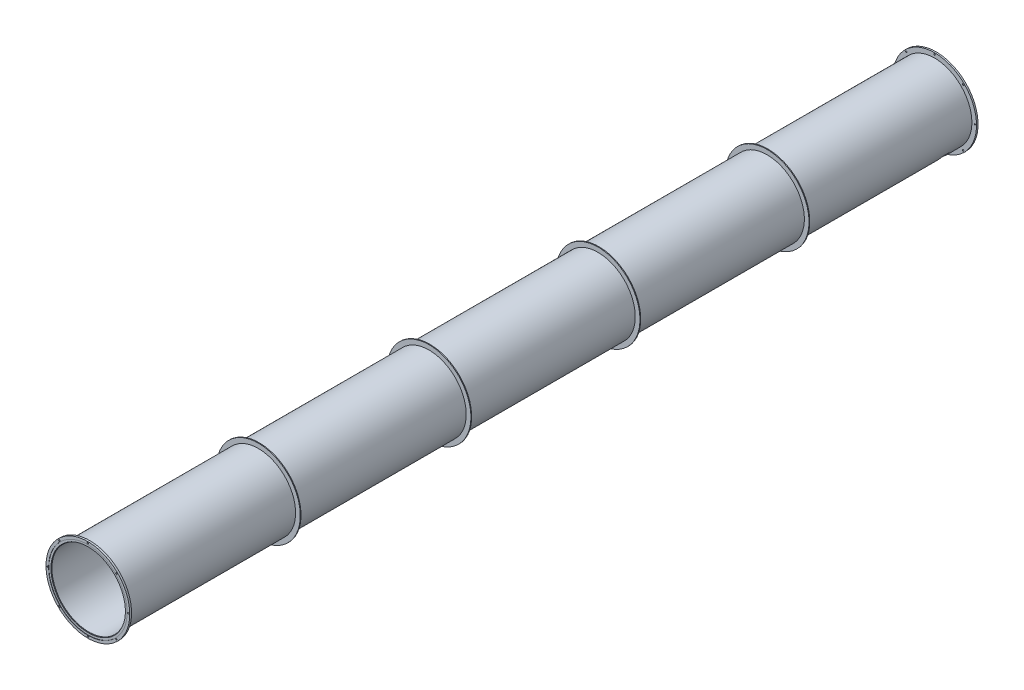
from build123d import *

# Parameters (mm, degrees)
F_7_8_0_875_DIAMETER_HOLE1_REACH  = 13934.361
F_7_8_0_875_DIAMETER_HOLE1_BORE_R = 11.1125
CIRPATTERN1_COUNT                 = 8
F_7_8_0_875_DIAMETER_HOLE2_REACH  = 13928.026
F_7_8_0_875_DIAMETER_HOLE2_BORE_R = 11.1125
CIRPATTERN2_COUNT                 = 8
SKETCH6_R                         = 76.2
CUT_EXTRUDE1_DEPTH                = 660.4
SKETCH7_R                         = 101.6
CUT_EXTRUDE2_DEPTH                = 660.4


with BuildPart() as part:
    # Sketch1 → Revolve1 (revolve)
    with BuildSketch(Plane(origin=(0, 0, 0), x_dir=(1, 0, 0), z_dir=(0, 1, 0)), mode=Mode.PRIVATE) as revolve1_sk:
        Polygon((603.25, 6937.375), (603.25, -6937.375), (609.6, -6943.725), (609.6, -6946.9), (642.9375, -6946.9), (642.9375, -6951.6625), (685.8, -6951.6625), (685.8, -6921.5), (609.6, -6921.5), (609.6, -4159.25), (685.8, -4159.25), (685.8, -4146.55), (609.6, -4146.55), (609.6, -1365.25), (685.8, -1365.25), (685.8, -1352.55), (609.6, -1352.55), (609.6, 1403.35), (685.8, 1403.35), (685.8, 1416.05), (609.6, 1416.05), (609.6, 4171.95), (685.8, 4171.95), (685.8, 4184.65), (609.6, 4184.65), (609.6, 6915.15), (685.8, 6915.15), (685.8, 6940.55), (641.35, 6940.55), (641.35, 6946.9), (632.449441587, 6946.9), (631.825, 6939.7626), (619.125, 6939.7626), (618.500558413, 6946.9), (609.6, 6946.9), (609.6, 6943.725), align=None)
    revolve(revolve1_sk.sketch.rotate(Axis((0, 0, -88.99), (0, 0, 1)), 180), axis=Axis((0, 0, -88.99), (0, 0, 1)))

    # 7_8 _0.875_ Diameter Hole1 bore → 7_8 _0.875_ Diameter Hole1 (cut, up to next)
    with BuildSketch(Plane.XY.offset(6951.6625), mode=Mode.PRIVATE) as f_7_8_0_875_diameter_hole1_sk1:
        with Locations((-660.4, 0)):
            Circle(F_7_8_0_875_DIAMETER_HOLE1_BORE_R)
    f_7_8_0_875_diameter_hole1_tool1 = extrude(f_7_8_0_875_diameter_hole1_sk1.sketch, amount=-F_7_8_0_875_DIAMETER_HOLE1_REACH, mode=Mode.PRIVATE) & part.part
    f_7_8_0_875_diameter_hole1 = f_7_8_0_875_diameter_hole1_tool1.solids().sort_by_distance((-660.4, 0, 6951.6625))[0]
    add(f_7_8_0_875_diameter_hole1, mode=Mode.SUBTRACT)

    # CirPattern1: 7_8 _0.875_ Diameter Hole1 ×8 about axis
    cirpattern1_axis = Axis((0, 0, 0), (0, 0, 1))
    for i in range(1, CIRPATTERN1_COUNT):
        add(f_7_8_0_875_diameter_hole1.rotate(cirpattern1_axis, i * 360 / CIRPATTERN1_COUNT), mode=Mode.SUBTRACT)

    # 7_8 _0.875_ Diameter Hole2 bore → 7_8 _0.875_ Diameter Hole2 (cut, up to next)
    with BuildSketch(Plane(origin=(0, 0, -6940.55), x_dir=(-1, 0, 0), z_dir=(0, 0, -1)), mode=Mode.PRIVATE) as f_7_8_0_875_diameter_hole2_sk1:
        with Locations((660.4, 0)):
            Circle(F_7_8_0_875_DIAMETER_HOLE2_BORE_R)
    f_7_8_0_875_diameter_hole2_tool1 = extrude(f_7_8_0_875_diameter_hole2_sk1.sketch, amount=-F_7_8_0_875_DIAMETER_HOLE2_REACH, mode=Mode.PRIVATE) & part.part
    f_7_8_0_875_diameter_hole2 = f_7_8_0_875_diameter_hole2_tool1.solids().sort_by_distance((-660.4, 0, -6940.55))[0]
    add(f_7_8_0_875_diameter_hole2, mode=Mode.SUBTRACT)

    # CirPattern2: 7_8 _0.875_ Diameter Hole2 ×8 about axis
    cirpattern2_axis = Axis((0, 0, 0), (0, 0, 1))
    for i in range(1, CIRPATTERN2_COUNT):
        add(f_7_8_0_875_diameter_hole2.rotate(cirpattern2_axis, i * 360 / CIRPATTERN2_COUNT), mode=Mode.SUBTRACT)

    # Sketch6 → Cut-Extrude1 (cut)
    with BuildSketch(Plane(origin=(0, 0, 0), x_dir=(0, 0, -1), z_dir=(1, 0, 0))):
        with Locations((6032.5, 0)):
            Circle(SKETCH6_R)
    extrude(amount=-CUT_EXTRUDE1_DEPTH, mode=Mode.SUBTRACT)

    # Sketch7 → Cut-Extrude2 (cut)
    with BuildSketch(Plane(origin=(0, 0, 0), x_dir=(0.7071067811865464, 0.7071067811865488, 0), z_dir=(-0.7071067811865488, 0.7071067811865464, 0))):
        with Locations(Location((0, 6610.35, 0), (0, 0, 180))):
            Circle(SKETCH7_R)
    extrude(amount=-CUT_EXTRUDE2_DEPTH, mode=Mode.SUBTRACT)


solid = part.part
